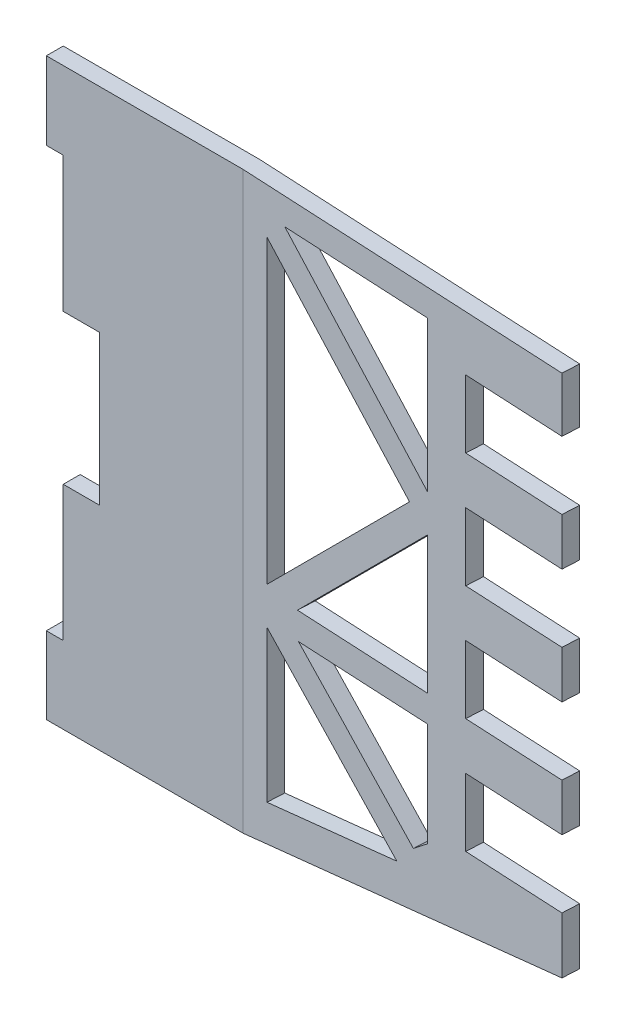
from build123d import *

# Parameters (mm, degrees)
SKETCH1_W                = 36.83
SKETCH1_H                = 5
BOSS_EXTRUDE1_DEPTH      = 106.172
CUT_EXTRUDE1_DEPTH       = 610.988381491
CUT_EXTRUDE1_DEPTH_BACK  = 610.988381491
CUT_EXTRUDE5_DEPTH       = 611.008820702
CUT_EXTRUDE6_DEPTH       = 610.988381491
CUT_EXTRUDE6_DEPTH_BACK  = 610.988381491
SKETCH7_W                = 10
SKETCH7_H                = 6
BOSS_EXTRUDE2_DEPTH      = 4.993573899
CUT_EXTRUDE7_DEPTH       = 611.008820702
CUT_EXTRUDE7_DEPTH_BACK  = 611.008820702
SKETCH12_W               = 19.05
SKETCH12_H               = 12.7
CUT_EXTRUDE8_DEPTH       = 608.408957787
CUT_EXTRUDE8_DEPTH_BACK  = 608.408957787
CUT_EXTRUDE9_DEPTH       = 147.182990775
CUT_EXTRUDE9_DEPTH_BACK  = 147.182990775
CUT_EXTRUDE10_DEPTH      = 147.038416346
CUT_EXTRUDE10_DEPTH_BACK = 147.038416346
BOSS_EXTRUDE3_START      = -3.175
SKETCH15_W               = 36.876278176
SKETCH15_H               = 1.745
BOSS_EXTRUDE3_DEPTH      = 3.175
BOSS_EXTRUDE7_DEPTH      = 1.745
BOSS_EXTRUDE8_DEPTH      = 3.168573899


with BuildPart() as part:
    # Sketch1 → Boss-Extrude1 (new body)
    with BuildSketch(Plane(origin=(0, 0, 0), x_dir=(1, 0, 0), z_dir=(0, 1, 0))):
        with Locations((18.415, 2.5)):
            Rectangle(SKETCH1_W, SKETCH1_H)
        Polygon((600, -28.58), (600, -23.58), (36.83, 5), (36.83, 0), align=None)
    extrude(amount=BOSS_EXTRUDE1_DEPTH)

    # Sketch2 → Cut-Extrude1 (cut, two sides: drawn at the far end of the back side and taken through both)
    with BuildSketch(Plane(origin=(0.094608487, 0, -1.86426388), x_dir=(0.9987147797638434, 0, 0.05068321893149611), z_dir=(-0.05068321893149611, 0, 0.9987147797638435)).offset(-CUT_EXTRUDE1_DEPTH_BACK)):
        Polygon((600.677394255, 84.16), (590.677394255, 84.16), (36.782665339, 0), (600.677394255, 0), align=None)
    extrude(amount=CUT_EXTRUDE1_DEPTH + CUT_EXTRUDE1_DEPTH_BACK, mode=Mode.SUBTRACT)

    # Sketch6 → Cut-Extrude5 (cut, through all)
    with BuildSketch(Plane(origin=(0.347698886, 0, -6.851419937), x_dir=(-0.9987147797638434, 0, -0.05068321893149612), z_dir=(0.05068321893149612, 0, -0.9987147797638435))):
        Polygon((-127.696367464, 18.871017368), (-107.529249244, 15.806780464), (-107.529249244, 33.309598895), align=None)
        Polygon((-102.529249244, 32.49635225), (-102.529249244, 15.047069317), (-75.335773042, 10.915231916), align=None)
        Polygon((-47.770552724, 35.172), (-97.857483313, 35.172), (-70.512874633, 13.470938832), align=None)
        Polygon((-166.029249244, 24.695400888), (-139.479710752, 20.661404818), (-166.029249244, 33.663921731), align=None)
        Polygon((-41.529249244, 34.216455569), (-67.237950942, 9.684830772), (-41.529249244, 5.778593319), align=None)
        Polygon((-131.480394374, 22.311204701), (-113.517052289, 35.172), (-157.74055478, 35.172), align=None)
        Polygon((-229.529249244, 34.343732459), (-171.029249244, 25.455112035), (-171.029249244, 35.172), (-229.529249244, 35.172), align=None)
        Polygon((-73.279249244, 65.886466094), (-98.993715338, 40.172), (-47.56478315, 40.172), align=None)
        Polygon((-162.493715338, 40.172), (-111.06478315, 40.172), (-136.779249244, 65.886466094), align=None)
        Polygon((-69.743715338, 69.422), (-41.529249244, 41.207533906), (-41.529249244, 97.636466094), align=None)
        Polygon((-102.529249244, 95.136466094), (-102.529249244, 43.707533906), (-76.81478315, 69.422), align=None)
        Polygon((-133.243715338, 69.422), (-107.529249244, 43.707533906), (-107.529249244, 95.136466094), align=None)
        Polygon((-166.029249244, 43.707533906), (-140.31478315, 69.422), (-166.029249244, 95.136466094), align=None)
        Polygon((-101.493715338, 101.172), (-73.279249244, 72.957533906), (-45.06478315, 101.172), align=None)
        Polygon((-164.993715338, 101.172), (-136.779249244, 72.957533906), (-108.56478315, 101.172), align=None)
        Polygon((-196.743715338, 69.422), (-171.029249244, 43.707533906), (-171.029249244, 95.136466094), align=None)
        Polygon((-225.993715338, 40.172), (-174.56478315, 40.172), (-200.279249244, 65.886466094), align=None)
        Polygon((-228.493715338, 101.172), (-200.279249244, 72.957533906), (-172.06478315, 101.172), align=None)
        Polygon((-229.529249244, 43.707533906), (-203.81478315, 69.422), (-229.529249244, 95.136466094), align=None)
        Polygon((-286.643861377, 43.021853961), (-267.887693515, 40.172), (-238.06478315, 40.172), (-263.779249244, 65.886466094), align=None)
        Polygon((-260.243715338, 69.422), (-234.529249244, 43.707533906), (-234.529249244, 95.136466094), align=None)
        Polygon((-293.029249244, 43.99206403), (-292.782248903, 43.954534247), (-267.31478315, 69.422), (-293.029249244, 95.136466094), align=None)
        Polygon((-291.993715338, 101.172), (-263.779249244, 72.957533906), (-235.56478315, 101.172), align=None)
        Polygon((-341.76815353, 51.397561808), (-307.598537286, 46.205754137), (-327.279249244, 65.886466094), align=None)
        Polygon((-323.743715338, 69.422), (-299.260581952, 44.938866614), (-298.029249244, 44.751775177), (-298.029249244, 95.136466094), align=None)
        Polygon((-356.529249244, 53.640395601), (-347.906541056, 52.330242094), (-330.81478315, 69.422), (-356.529249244, 95.136466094), align=None)
        Polygon((-355.493715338, 101.172), (-327.279249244, 72.957533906), (-299.06478315, 101.172), align=None)
        Polygon((-387.243715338, 69.422), (-374.137556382, 56.315841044), (-361.529249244, 54.400106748), (-361.529249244, 95.136466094), align=None)
        Polygon((-420.029249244, 63.288727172), (-403.030833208, 60.705949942), (-394.31478315, 69.422), (-420.029249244, 95.136466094), align=None)
        Polygon((-418.993715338, 101.172), (-390.779249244, 72.957533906), (-362.56478315, 101.172), align=None)
        Polygon((-450.743715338, 69.422), (-449.014530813, 67.692815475), (-425.029249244, 64.048438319), (-425.029249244, 95.136466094), align=None)
        Polygon((-458.155125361, 69.081657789), (-457.81478315, 69.422), (-483.529249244, 95.136466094), (-483.529249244, 72.937058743), align=None)
        Polygon((-482.493715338, 101.172), (-454.279249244, 72.957533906), (-426.06478315, 101.172), align=None)
        Polygon((-547.029249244, 82.585390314), (-532.229460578, 80.336677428), (-547.029249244, 95.136466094), align=None)
        Polygon((-507.141029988, 76.52468535), (-488.529249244, 73.69676989), (-488.529249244, 95.136466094), align=None)
        Polygon((-545.993715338, 101.172), (-523.891505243, 79.069789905), (-513.279417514, 77.457365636), (-489.56478315, 101.172), align=None)
    extrude(amount=-CUT_EXTRUDE5_DEPTH, mode=Mode.SUBTRACT)

    # Sketch7 → Cut-Extrude6 (cut, two sides: drawn at the far end of the back side and taken through both)
    with BuildSketch(Plane(origin=(0.094608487, 0, -1.86426388), x_dir=(0.9987147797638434, 0, 0.05068321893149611), z_dir=(-0.05068321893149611, 0, 0.9987147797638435)).offset(-CUT_EXTRUDE6_DEPTH_BACK)):
        with Locations((595.677394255, 103.172)):
            Rectangle(SKETCH7_W, SKETCH7_H)
        with Locations((595.677394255, 87.16)):
            Rectangle(SKETCH7_W, SKETCH7_H)
    extrude(amount=CUT_EXTRUDE6_DEPTH + CUT_EXTRUDE6_DEPTH_BACK, mode=Mode.SUBTRACT)

    # Sketch11 → Boss-Extrude2 (add)
    with BuildSketch(Plane(origin=(0.347698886, 0, -6.851419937), x_dir=(-0.9987147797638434, 0, -0.05068321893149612), z_dir=(0.05068321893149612, 0, -0.9987147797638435))):
        Polygon((-73.279249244, 5.545372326), (-73.279249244, 72.957533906), (-73.279249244, 106.172), (-102.529249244, 106.172), (-102.529249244, 95.136466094), (-102.529249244, 43.707533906), (-102.529249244, 9.989682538), align=None)
    extrude(amount=-BOSS_EXTRUDE2_DEPTH)

    # Sketch12 → Cut-Extrude7 (cut, two sides: drawn at the far end of the back side and taken through both)
    with BuildSketch(Plane(origin=(0.347698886, 0, -6.851419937), x_dir=(-0.9987147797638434, 0, -0.05068321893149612), z_dir=(0.05068321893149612, 0, -0.9987147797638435)).offset(-CUT_EXTRUDE7_DEPTH_BACK)):
        Polygon((-99.929249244, 67.954691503), (-99.929249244, 74.304691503), (-99.929249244, 83.194691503), (-99.929249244, 89.544691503), (-99.929249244, 95.894691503), (-99.929249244, 106.172), (-590.677394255, 106.172), (-590.677394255, 100.172), (-600.423978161, 100.172), (-600.423978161, 90.16), (-590.677394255, 90.16), (-590.677394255, 84.16), (-99.929249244, 9.594632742), (-99.929249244, 18.424691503), (-99.929249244, 31.124691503), (-99.929249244, 40.014691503), (-99.929249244, 52.714691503), (-99.929249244, 61.604691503), align=None)
        Polygon((-99.929249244, 95.894691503), (-99.929249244, 89.544691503), (-80.879249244, 89.384446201), (-80.879249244, 95.894691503), align=None)
        Polygon((-99.929249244, 89.544691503), (-99.929249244, 83.194691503), (-80.879249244, 83.194691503), (-80.879249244, 89.384446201), align=None)
        Polygon((-80.879249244, 74.304691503), (-99.929249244, 74.304691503), (-99.929249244, 67.954691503), (-80.879249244, 66.158224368), align=None)
        Polygon((-80.879249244, 66.158224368), (-99.929249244, 67.954691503), (-99.929249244, 61.604691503), (-80.879249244, 61.604691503), align=None)
        with Locations((-90.404249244, 46.364691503)):
            Rectangle(SKETCH12_W, SKETCH12_H)
        with Locations((-90.404249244, 24.774691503)):
            Rectangle(SKETCH12_W, SKETCH12_H)
    extrude(amount=CUT_EXTRUDE7_DEPTH + CUT_EXTRUDE7_DEPTH_BACK, mode=Mode.SUBTRACT)


with BuildPart() as cut_extrude7_piece_1:
    # of the separate pieces the step leaves, piece 1, a body of its own (cut_extrude7_pieces)
    add(part.part.solids().sort_by_distance((0, 0, 0))[0])

    # Sketch3 → Cut-Extrude9 (cut, two sides: drawn at the far end of the back side and taken through both)
    with BuildSketch(Plane(origin=(0, 0, -5), x_dir=(-1, 0, 0), z_dir=(0, 0, -1)).offset(-CUT_EXTRUDE9_DEPTH_BACK)):
        Polygon((0, 410.812332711), (0, 106.172), (0, 91.599999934), (-3.1749492, 91.599999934), (-3.1749492, 66.199999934), (-10, 66.199999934), (-10, 38.1), (-3.1749492, 38.1), (-3.1749492, 12.7), (0, 12.7), (0, -1.872000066), (0, -306.512332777), (609.280665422, -306.512332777), (609.280665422, 410.812332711), align=None)
    extrude(amount=CUT_EXTRUDE9_DEPTH + CUT_EXTRUDE9_DEPTH_BACK, mode=Mode.SUBTRACT)

    # Sketch14 → Cut-Extrude10 (cut, two sides: drawn at the far end of the back side and taken through both)
    with BuildSketch(Plane(origin=(0, 106.172, 0), x_dir=(1, 0, 0), z_dir=(0, 1, 0)).offset(-CUT_EXTRUDE10_DEPTH_BACK)):
        Polygon((36.83, 0), (99.895426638, -3.200472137), (99.987923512, -1.377817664), (36.876278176, 1.825), (0, 1.825), (0, 0), align=None)
    extrude(amount=CUT_EXTRUDE10_DEPTH + CUT_EXTRUDE10_DEPTH_BACK, mode=Mode.SUBTRACT)

    # Sketch15 → Boss-Extrude3 (add)
    with BuildSketch(Plane.XY.offset(-1.825).offset(BOSS_EXTRUDE3_START)):
        with Locations((18.438139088, -0.8725)):
            Rectangle(SKETCH15_W, SKETCH15_H)
    extrude(amount=BOSS_EXTRUDE3_DEPTH)

    # Sketch17 → Boss-Extrude7 (add)
    with BuildSketch(Plane.XZ):
        Polygon((36.876278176, -5), (37.083090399, -4.987156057), (36.922496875, -1.822654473), (36.876278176, -1.825), align=None)
    extrude(amount=BOSS_EXTRUDE7_DEPTH)

    # Sketch18 → Boss-Extrude8 (add)
    with BuildSketch(Plane(origin=(0.187105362, 0, -3.686918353), x_dir=(0.9987147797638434, 0, 0.05068321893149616), z_dir=(-0.05068321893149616, 0, 0.9987147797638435))):
        Polygon((36.782665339, 0), (99.929249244, 9.594632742), (99.929249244, 7.849632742), (36.782665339, -1.745), align=None)
    extrude(amount=-BOSS_EXTRUDE8_DEPTH)


with BuildPart() as cut_extrude7_piece_2:
    # of the separate pieces the step leaves, piece 2, a body of its own (cut_extrude7_pieces)
    add(part.part.solids().sort_by_distance((599.746909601, 90.16, 28.567156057))[0])

    # Sketch13 → Cut-Extrude8 (cut, two sides: drawn at the far end of the back side and taken through both)
    with BuildSketch(Plane(origin=(600, 90.16, 23.58), x_dir=(1, 0, 0), z_dir=(0, -1, 0)).offset(-CUT_EXTRUDE8_DEPTH_BACK)):
        Polygon((-14.825275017, 17.559183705), (-10.900509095, -22.080952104), (20.890094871, -10.306654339), (17.554043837, 36.986775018), align=None)
    extrude(amount=CUT_EXTRUDE8_DEPTH + CUT_EXTRUDE8_DEPTH_BACK, mode=Mode.SUBTRACT)


solid = cut_extrude7_piece_1.part
